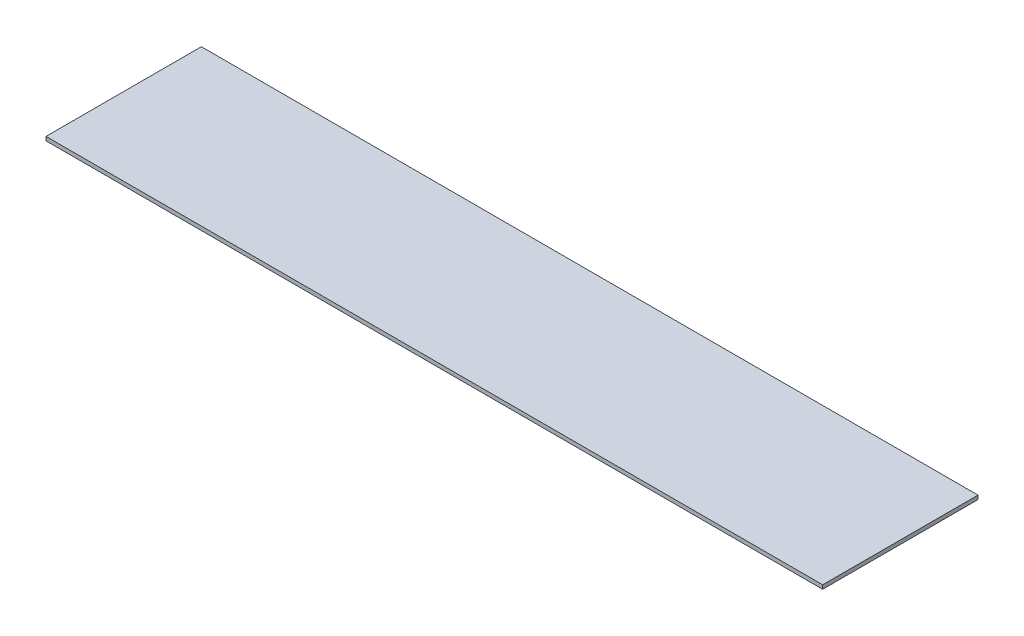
ISO-10303-21;
HEADER;
FILE_DESCRIPTION(('STEP AP214'),'2;1');
FILE_NAME('part.step','',(''),(''),'','','');
FILE_SCHEMA(('AUTOMOTIVE_DESIGN { 1 0 10303 214 1 1 1 1 }'));
ENDSEC;
DATA;
#1=APPLICATION_CONTEXT('core data for automotive mechanical design processes');
#2=APPLICATION_PROTOCOL_DEFINITION('international standard','automotive_design',2000,#1);
#3=PRODUCT_CONTEXT('',#1,'mechanical');
#4=PRODUCT('Part','Part','',(#3));
#5=PRODUCT_RELATED_PRODUCT_CATEGORY('part','',(#4));
#6=PRODUCT_DEFINITION_FORMATION('','',#4);
#7=PRODUCT_DEFINITION_CONTEXT('part definition',#1,'design');
#8=PRODUCT_DEFINITION('design','',#6,#7);
#9=PRODUCT_DEFINITION_SHAPE('','',#8);
#10=(LENGTH_UNIT() NAMED_UNIT(*) SI_UNIT(.MILLI.,.METRE.));
#11=(NAMED_UNIT(*) PLANE_ANGLE_UNIT() SI_UNIT($,.RADIAN.));
#12=(NAMED_UNIT(*) SI_UNIT($,.STERADIAN.) SOLID_ANGLE_UNIT());
#13=UNCERTAINTY_MEASURE_WITH_UNIT(LENGTH_MEASURE(1.E-05),#10,'distance_accuracy_value','');
#14=(GEOMETRIC_REPRESENTATION_CONTEXT(3) GLOBAL_UNCERTAINTY_ASSIGNED_CONTEXT((#13)) GLOBAL_UNIT_ASSIGNED_CONTEXT((#10,
#11,#12)) REPRESENTATION_CONTEXT('',''));
#15=CARTESIAN_POINT('',(0.,0.,0.));
#16=DIRECTION('',(0.,0.,1.));
#17=DIRECTION('',(1.,0.,0.));
#18=AXIS2_PLACEMENT_3D('',#15,#16,#17);
#19=CARTESIAN_POINT('',(0.,0.,200.));
#20=DIRECTION('',(1.,0.,0.));
#21=DIRECTION('',(0.,1.,0.));
#22=AXIS2_PLACEMENT_3D('',#19,#20,#21);
#23=PLANE('',#22);
#24=DIRECTION('',(0.,-1.,0.));
#25=VECTOR('',#24,1.);
#26=CARTESIAN_POINT('',(0.,0.,-200.));
#27=LINE('',#26,#25);
#28=CARTESIAN_POINT('',(0.,0.,-200.));
#29=VERTEX_POINT('',#28);
#30=CARTESIAN_POINT('',(0.,-9.99999999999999,-200.));
#31=VERTEX_POINT('',#30);
#32=EDGE_CURVE('E102',#29,#31,#27,.T.);
#33=ORIENTED_EDGE('',*,*,#32,.T.);
#34=DIRECTION('',(0.,0.,-1.));
#35=VECTOR('',#34,1.);
#36=CARTESIAN_POINT('',(0.,-9.99999999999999,200.));
#37=LINE('',#36,#35);
#38=CARTESIAN_POINT('',(0.,-9.99999999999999,200.));
#39=VERTEX_POINT('',#38);
#40=EDGE_CURVE('E11',#39,#31,#37,.T.);
#41=ORIENTED_EDGE('',*,*,#40,.F.);
#42=DIRECTION('',(0.,-1.,0.));
#43=VECTOR('',#42,1.);
#44=CARTESIAN_POINT('',(0.,0.,200.));
#45=LINE('',#44,#43);
#46=CARTESIAN_POINT('',(0.,0.,200.));
#47=VERTEX_POINT('',#46);
#48=EDGE_CURVE('E90',#47,#39,#45,.T.);
#49=ORIENTED_EDGE('',*,*,#48,.F.);
#50=DIRECTION('',(0.,0.,-1.));
#51=VECTOR('',#50,1.);
#52=CARTESIAN_POINT('',(0.,0.,200.));
#53=LINE('',#52,#51);
#54=EDGE_CURVE('E98',#47,#29,#53,.T.);
#55=ORIENTED_EDGE('',*,*,#54,.T.);
#56=EDGE_LOOP('',(#33,#41,#49,#55));
#57=FACE_BOUND('',#56,.T.);
#58=ADVANCED_FACE('F39',(#57),#23,.F.);
#59=CARTESIAN_POINT('',(0.,-9.99999999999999,200.));
#60=DIRECTION('',(0.,1.,0.));
#61=DIRECTION('',(0.,0.,1.));
#62=AXIS2_PLACEMENT_3D('',#59,#60,#61);
#63=PLANE('',#62);
#64=DIRECTION('',(1.,0.,0.));
#65=VECTOR('',#64,1.);
#66=CARTESIAN_POINT('',(0.,-9.99999999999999,-200.));
#67=LINE('',#66,#65);
#68=CARTESIAN_POINT('',(2000.,-9.99999999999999,-200.));
#69=VERTEX_POINT('',#68);
#70=EDGE_CURVE('E94',#31,#69,#67,.T.);
#71=ORIENTED_EDGE('',*,*,#70,.T.);
#72=DIRECTION('',(0.,0.,-1.));
#73=VECTOR('',#72,1.);
#74=CARTESIAN_POINT('',(2000.,-9.99999999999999,200.));
#75=LINE('',#74,#73);
#76=CARTESIAN_POINT('',(2000.,-9.99999999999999,200.));
#77=VERTEX_POINT('',#76);
#78=EDGE_CURVE('E47',#77,#69,#75,.T.);
#79=ORIENTED_EDGE('',*,*,#78,.F.);
#80=DIRECTION('',(1.,0.,0.));
#81=VECTOR('',#80,1.);
#82=CARTESIAN_POINT('',(0.,-9.99999999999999,200.));
#83=LINE('',#82,#81);
#84=EDGE_CURVE('E85',#39,#77,#83,.T.);
#85=ORIENTED_EDGE('',*,*,#84,.F.);
#86=ORIENTED_EDGE('',*,*,#40,.T.);
#87=EDGE_LOOP('',(#71,#79,#85,#86));
#88=FACE_BOUND('',#87,.T.);
#89=ADVANCED_FACE('F93',(#88),#63,.F.);
#90=CARTESIAN_POINT('',(2000.,0.,200.));
#91=DIRECTION('',(-1.,0.,0.));
#92=DIRECTION('',(0.,0.,1.));
#93=AXIS2_PLACEMENT_3D('',#90,#91,#92);
#94=PLANE('',#93);
#95=DIRECTION('',(0.,1.,0.));
#96=VECTOR('',#95,1.);
#97=CARTESIAN_POINT('',(2000.,0.,-200.));
#98=LINE('',#97,#96);
#99=CARTESIAN_POINT('',(2000.,0.,-200.));
#100=VERTEX_POINT('',#99);
#101=EDGE_CURVE('E72',#69,#100,#98,.T.);
#102=ORIENTED_EDGE('',*,*,#101,.T.);
#103=DIRECTION('',(0.,0.,-1.));
#104=VECTOR('',#103,1.);
#105=CARTESIAN_POINT('',(2000.,0.,200.));
#106=LINE('',#105,#104);
#107=CARTESIAN_POINT('',(2000.,0.,200.));
#108=VERTEX_POINT('',#107);
#109=EDGE_CURVE('E95',#108,#100,#106,.T.);
#110=ORIENTED_EDGE('',*,*,#109,.F.);
#111=DIRECTION('',(0.,1.,0.));
#112=VECTOR('',#111,1.);
#113=CARTESIAN_POINT('',(2000.,0.,200.));
#114=LINE('',#113,#112);
#115=EDGE_CURVE('E88',#77,#108,#114,.T.);
#116=ORIENTED_EDGE('',*,*,#115,.F.);
#117=ORIENTED_EDGE('',*,*,#78,.T.);
#118=EDGE_LOOP('',(#102,#110,#116,#117));
#119=FACE_BOUND('',#118,.T.);
#120=ADVANCED_FACE('F96',(#119),#94,.F.);
#121=CARTESIAN_POINT('',(0.,0.,200.));
#122=DIRECTION('',(0.,-1.,0.));
#123=DIRECTION('',(0.,0.,-1.));
#124=AXIS2_PLACEMENT_3D('',#121,#122,#123);
#125=PLANE('',#124);
#126=DIRECTION('',(-1.,0.,0.));
#127=VECTOR('',#126,1.);
#128=CARTESIAN_POINT('',(0.,0.,-200.));
#129=LINE('',#128,#127);
#130=EDGE_CURVE('E78',#100,#29,#129,.T.);
#131=ORIENTED_EDGE('',*,*,#130,.T.);
#132=ORIENTED_EDGE('',*,*,#54,.F.);
#133=DIRECTION('',(-1.,0.,0.));
#134=VECTOR('',#133,1.);
#135=CARTESIAN_POINT('',(0.,0.,200.));
#136=LINE('',#135,#134);
#137=EDGE_CURVE('E55',#108,#47,#136,.T.);
#138=ORIENTED_EDGE('',*,*,#137,.F.);
#139=ORIENTED_EDGE('',*,*,#109,.T.);
#140=EDGE_LOOP('',(#131,#132,#138,#139));
#141=FACE_BOUND('',#140,.T.);
#142=ADVANCED_FACE('F109',(#141),#125,.F.);
#143=CARTESIAN_POINT('',(0.,0.,200.));
#144=DIRECTION('',(0.,0.,1.));
#145=DIRECTION('',(1.,0.,0.));
#146=AXIS2_PLACEMENT_3D('',#143,#144,#145);
#147=PLANE('',#146);
#148=ORIENTED_EDGE('',*,*,#48,.T.);
#149=ORIENTED_EDGE('',*,*,#84,.T.);
#150=ORIENTED_EDGE('',*,*,#115,.T.);
#151=ORIENTED_EDGE('',*,*,#137,.T.);
#152=EDGE_LOOP('',(#148,#149,#150,#151));
#153=FACE_BOUND('',#152,.T.);
#154=ADVANCED_FACE('F86',(#153),#147,.T.);
#155=CARTESIAN_POINT('',(0.,0.,-200.));
#156=DIRECTION('',(0.,0.,1.));
#157=DIRECTION('',(1.,0.,0.));
#158=AXIS2_PLACEMENT_3D('',#155,#156,#157);
#159=PLANE('',#158);
#160=ORIENTED_EDGE('',*,*,#32,.F.);
#161=ORIENTED_EDGE('',*,*,#130,.F.);
#162=ORIENTED_EDGE('',*,*,#101,.F.);
#163=ORIENTED_EDGE('',*,*,#70,.F.);
#164=EDGE_LOOP('',(#160,#161,#162,#163));
#165=FACE_BOUND('',#164,.T.);
#166=ADVANCED_FACE('F112',(#165),#159,.F.);
#167=CLOSED_SHELL('',(#58,#89,#120,#142,#154,#166));
#168=MANIFOLD_SOLID_BREP('B2',#167);
#169=ADVANCED_BREP_SHAPE_REPRESENTATION('',(#18,#168),#14);
#170=SHAPE_DEFINITION_REPRESENTATION(#9,#169);
ENDSEC;
END-ISO-10303-21;
